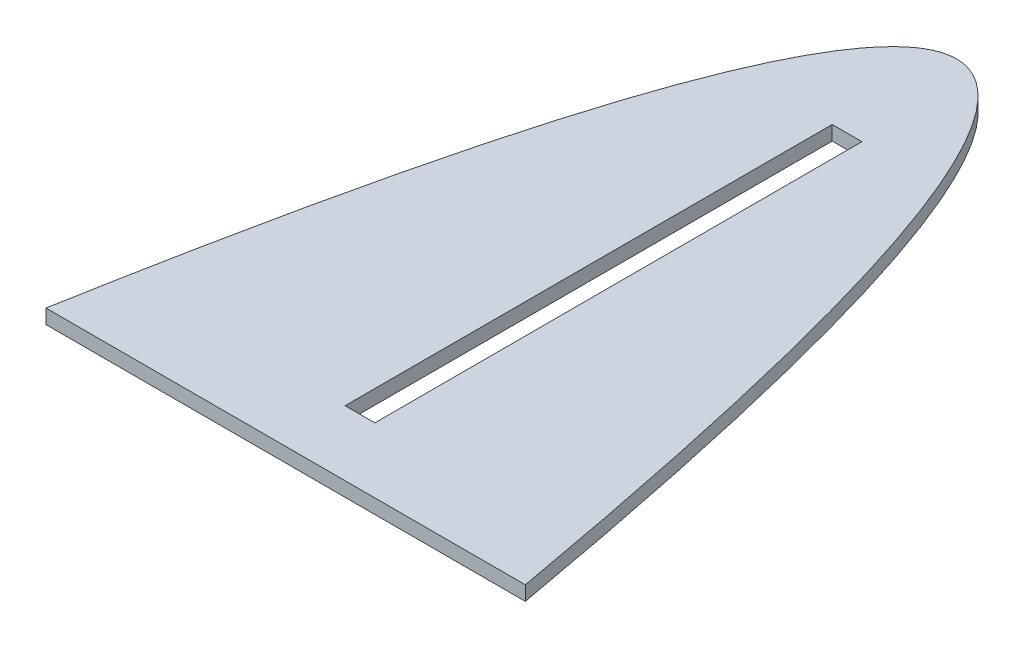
ISO-10303-21;
HEADER;
FILE_DESCRIPTION(('STEP AP214'),'2;1');
FILE_NAME('part.step','',(''),(''),'','','');
FILE_SCHEMA(('AUTOMOTIVE_DESIGN { 1 0 10303 214 1 1 1 1 }'));
ENDSEC;
DATA;
#1=APPLICATION_CONTEXT('core data for automotive mechanical design processes');
#2=APPLICATION_PROTOCOL_DEFINITION('international standard','automotive_design',2000,#1);
#3=PRODUCT_CONTEXT('',#1,'mechanical');
#4=PRODUCT('Part','Part','',(#3));
#5=PRODUCT_RELATED_PRODUCT_CATEGORY('part','',(#4));
#6=PRODUCT_DEFINITION_FORMATION('','',#4);
#7=PRODUCT_DEFINITION_CONTEXT('part definition',#1,'design');
#8=PRODUCT_DEFINITION('design','',#6,#7);
#9=PRODUCT_DEFINITION_SHAPE('','',#8);
#10=(LENGTH_UNIT() NAMED_UNIT(*) SI_UNIT(.MILLI.,.METRE.));
#11=(NAMED_UNIT(*) PLANE_ANGLE_UNIT() SI_UNIT($,.RADIAN.));
#12=(NAMED_UNIT(*) SI_UNIT($,.STERADIAN.) SOLID_ANGLE_UNIT());
#13=UNCERTAINTY_MEASURE_WITH_UNIT(LENGTH_MEASURE(1.E-05),#10,'distance_accuracy_value','');
#14=(GEOMETRIC_REPRESENTATION_CONTEXT(3) GLOBAL_UNCERTAINTY_ASSIGNED_CONTEXT((#13)) GLOBAL_UNIT_ASSIGNED_CONTEXT((#10,
#11,#12)) REPRESENTATION_CONTEXT('',''));
#15=CARTESIAN_POINT('',(0.,0.,0.));
#16=DIRECTION('',(0.,0.,1.));
#17=DIRECTION('',(1.,0.,0.));
#18=AXIS2_PLACEMENT_3D('',#15,#16,#17);
#19=CARTESIAN_POINT('',(100.,3.,0.));
#20=CARTESIAN_POINT('',(50.,3.,-280.));
#21=CARTESIAN_POINT('',(0.,3.,0.));
#22=B_SPLINE_CURVE_WITH_KNOTS('',2,(#19,#20,#21),.UNSPECIFIED.,.F.,.F.,(3,3),(0.,1.),.UNSPECIFIED.);
#23=DIRECTION('',(0.,-1.,0.));
#24=VECTOR('',#23,1.);
#25=SURFACE_OF_LINEAR_EXTRUSION('',#22,#24);
#26=CARTESIAN_POINT('',(100.,0.,0.));
#27=CARTESIAN_POINT('',(50.,0.,-280.));
#28=CARTESIAN_POINT('',(0.,0.,0.));
#29=B_SPLINE_CURVE_WITH_KNOTS('',2,(#26,#27,#28),.UNSPECIFIED.,.F.,.F.,(3,3),(0.,1.),.UNSPECIFIED.);
#30=CARTESIAN_POINT('',(100.,0.,0.));
#31=VERTEX_POINT('',#30);
#32=CARTESIAN_POINT('',(0.,0.,0.));
#33=VERTEX_POINT('',#32);
#34=EDGE_CURVE('E102',#31,#33,#29,.T.);
#35=ORIENTED_EDGE('',*,*,#34,.T.);
#36=DIRECTION('',(0.,-1.,0.));
#37=VECTOR('',#36,1.);
#38=CARTESIAN_POINT('',(0.,3.,0.));
#39=LINE('',#38,#37);
#40=CARTESIAN_POINT('',(0.,3.,0.));
#41=VERTEX_POINT('',#40);
#42=EDGE_CURVE('E11',#41,#33,#39,.T.);
#43=ORIENTED_EDGE('',*,*,#42,.F.);
#44=CARTESIAN_POINT('',(100.,3.,0.));
#45=VERTEX_POINT('',#44);
#46=EDGE_CURVE('E124',#45,#41,#22,.T.);
#47=ORIENTED_EDGE('',*,*,#46,.F.);
#48=DIRECTION('',(0.,-1.,0.));
#49=VECTOR('',#48,1.);
#50=CARTESIAN_POINT('',(100.,3.,0.));
#51=LINE('',#50,#49);
#52=EDGE_CURVE('E43',#45,#31,#51,.T.);
#53=ORIENTED_EDGE('',*,*,#52,.T.);
#54=EDGE_LOOP('',(#35,#43,#47,#53));
#55=FACE_BOUND('',#54,.T.);
#56=ADVANCED_FACE('F35',(#55),#25,.F.);
#57=CARTESIAN_POINT('',(0.,3.,0.));
#58=DIRECTION('',(0.,0.,-1.));
#59=DIRECTION('',(-1.,0.,0.));
#60=AXIS2_PLACEMENT_3D('',#57,#58,#59);
#61=PLANE('',#60);
#62=DIRECTION('',(1.,0.,0.));
#63=VECTOR('',#62,1.);
#64=CARTESIAN_POINT('',(0.,0.,0.));
#65=LINE('',#64,#63);
#66=EDGE_CURVE('E131',#33,#31,#65,.T.);
#67=ORIENTED_EDGE('',*,*,#66,.T.);
#68=ORIENTED_EDGE('',*,*,#52,.F.);
#69=DIRECTION('',(1.,0.,0.));
#70=VECTOR('',#69,1.);
#71=CARTESIAN_POINT('',(0.,3.,0.));
#72=LINE('',#71,#70);
#73=EDGE_CURVE('E130',#41,#45,#72,.T.);
#74=ORIENTED_EDGE('',*,*,#73,.F.);
#75=ORIENTED_EDGE('',*,*,#42,.T.);
#76=EDGE_LOOP('',(#67,#68,#74,#75));
#77=FACE_BOUND('',#76,.T.);
#78=ADVANCED_FACE('F150',(#77),#61,.F.);
#79=CARTESIAN_POINT('',(50.,3.,-140.));
#80=DIRECTION('',(0.,1.,0.));
#81=DIRECTION('',(0.,0.,1.));
#82=AXIS2_PLACEMENT_3D('',#79,#80,#81);
#83=PLANE('',#82);
#84=DIRECTION('',(0.,0.,1.));
#85=VECTOR('',#84,1.);
#86=CARTESIAN_POINT('',(48.8514830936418,3.,-115.171268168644));
#87=LINE('',#86,#85);
#88=CARTESIAN_POINT('',(48.8514830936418,3.,-115.171268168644));
#89=VERTEX_POINT('',#88);
#90=CARTESIAN_POINT('',(48.8514830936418,3.,-13.5606255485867));
#91=VERTEX_POINT('',#90);
#92=EDGE_CURVE('E50',#89,#91,#87,.T.);
#93=ORIENTED_EDGE('',*,*,#92,.F.);
#94=DIRECTION('',(-1.,0.,0.));
#95=VECTOR('',#94,1.);
#96=CARTESIAN_POINT('',(48.8514830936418,3.,-115.171268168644));
#97=LINE('',#96,#95);
#98=CARTESIAN_POINT('',(55.0514830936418,3.,-115.171268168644));
#99=VERTEX_POINT('',#98);
#100=EDGE_CURVE('E96',#99,#89,#97,.T.);
#101=ORIENTED_EDGE('',*,*,#100,.F.);
#102=DIRECTION('',(0.,0.,-1.));
#103=VECTOR('',#102,1.);
#104=CARTESIAN_POINT('',(55.0514830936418,3.,-115.171268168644));
#105=LINE('',#104,#103);
#106=CARTESIAN_POINT('',(55.0514830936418,3.,-13.5606255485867));
#107=VERTEX_POINT('',#106);
#108=EDGE_CURVE('E116',#107,#99,#105,.T.);
#109=ORIENTED_EDGE('',*,*,#108,.F.);
#110=DIRECTION('',(1.,0.,0.));
#111=VECTOR('',#110,1.);
#112=CARTESIAN_POINT('',(48.8514830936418,3.,-13.5606255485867));
#113=LINE('',#112,#111);
#114=EDGE_CURVE('E110',#91,#107,#113,.T.);
#115=ORIENTED_EDGE('',*,*,#114,.F.);
#116=EDGE_LOOP('',(#93,#101,#109,#115));
#117=FACE_BOUND('',#116,.T.);
#118=ORIENTED_EDGE('',*,*,#46,.T.);
#119=ORIENTED_EDGE('',*,*,#73,.T.);
#120=EDGE_LOOP('',(#118,#119));
#121=FACE_BOUND('',#120,.T.);
#122=ADVANCED_FACE('F152',(#117,#121),#83,.T.);
#123=CARTESIAN_POINT('',(50.,0.,-140.));
#124=DIRECTION('',(0.,1.,0.));
#125=DIRECTION('',(0.,0.,1.));
#126=AXIS2_PLACEMENT_3D('',#123,#124,#125);
#127=PLANE('',#126);
#128=DIRECTION('',(1.,0.,0.));
#129=VECTOR('',#128,1.);
#130=CARTESIAN_POINT('',(48.8514830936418,0.,-115.171268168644));
#131=LINE('',#130,#129);
#132=CARTESIAN_POINT('',(48.8514830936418,0.,-115.171268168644));
#133=VERTEX_POINT('',#132);
#134=CARTESIAN_POINT('',(55.0514830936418,0.,-115.171268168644));
#135=VERTEX_POINT('',#134);
#136=EDGE_CURVE('E108',#133,#135,#131,.T.);
#137=ORIENTED_EDGE('',*,*,#136,.F.);
#138=DIRECTION('',(0.,0.,-1.));
#139=VECTOR('',#138,1.);
#140=CARTESIAN_POINT('',(48.8514830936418,0.,-115.171268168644));
#141=LINE('',#140,#139);
#142=CARTESIAN_POINT('',(48.8514830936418,0.,-13.5606255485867));
#143=VERTEX_POINT('',#142);
#144=EDGE_CURVE('E90',#143,#133,#141,.T.);
#145=ORIENTED_EDGE('',*,*,#144,.F.);
#146=DIRECTION('',(-1.,0.,0.));
#147=VECTOR('',#146,1.);
#148=CARTESIAN_POINT('',(48.8514830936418,0.,-13.5606255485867));
#149=LINE('',#148,#147);
#150=CARTESIAN_POINT('',(55.0514830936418,0.,-13.5606255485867));
#151=VERTEX_POINT('',#150);
#152=EDGE_CURVE('E99',#151,#143,#149,.T.);
#153=ORIENTED_EDGE('',*,*,#152,.F.);
#154=DIRECTION('',(0.,0.,1.));
#155=VECTOR('',#154,1.);
#156=CARTESIAN_POINT('',(55.0514830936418,0.,-115.171268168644));
#157=LINE('',#156,#155);
#158=EDGE_CURVE('E58',#135,#151,#157,.T.);
#159=ORIENTED_EDGE('',*,*,#158,.F.);
#160=EDGE_LOOP('',(#137,#145,#153,#159));
#161=FACE_BOUND('',#160,.T.);
#162=ORIENTED_EDGE('',*,*,#34,.F.);
#163=ORIENTED_EDGE('',*,*,#66,.F.);
#164=EDGE_LOOP('',(#162,#163));
#165=FACE_BOUND('',#164,.T.);
#166=ADVANCED_FACE('F105',(#161,#165),#127,.F.);
#167=CARTESIAN_POINT('',(48.8514830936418,-0.00100000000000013,-115.171268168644));
#168=DIRECTION('',(-1.,0.,0.));
#169=DIRECTION('',(0.,0.,1.));
#170=AXIS2_PLACEMENT_3D('',#167,#168,#169);
#171=PLANE('',#170);
#172=ORIENTED_EDGE('',*,*,#144,.T.);
#173=DIRECTION('',(0.,1.,0.));
#174=VECTOR('',#173,1.);
#175=CARTESIAN_POINT('',(48.8514830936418,-0.00100000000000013,-115.171268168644));
#176=LINE('',#175,#174);
#177=EDGE_CURVE('E103',#133,#89,#176,.T.);
#178=ORIENTED_EDGE('',*,*,#177,.T.);
#179=ORIENTED_EDGE('',*,*,#92,.T.);
#180=DIRECTION('',(0.,1.,0.));
#181=VECTOR('',#180,1.);
#182=CARTESIAN_POINT('',(48.8514830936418,-0.00100000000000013,-13.5606255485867));
#183=LINE('',#182,#181);
#184=EDGE_CURVE('E86',#143,#91,#183,.T.);
#185=ORIENTED_EDGE('',*,*,#184,.F.);
#186=EDGE_LOOP('',(#172,#178,#179,#185));
#187=FACE_BOUND('',#186,.T.);
#188=ADVANCED_FACE('F88',(#187),#171,.F.);
#189=CARTESIAN_POINT('',(48.8514830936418,-0.00100000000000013,-115.171268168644));
#190=DIRECTION('',(0.,0.,-1.));
#191=DIRECTION('',(-1.,0.,0.));
#192=AXIS2_PLACEMENT_3D('',#189,#190,#191);
#193=PLANE('',#192);
#194=ORIENTED_EDGE('',*,*,#136,.T.);
#195=DIRECTION('',(0.,1.,0.));
#196=VECTOR('',#195,1.);
#197=CARTESIAN_POINT('',(55.0514830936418,-0.00100000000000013,-115.171268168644));
#198=LINE('',#197,#196);
#199=EDGE_CURVE('E122',#135,#99,#198,.T.);
#200=ORIENTED_EDGE('',*,*,#199,.T.);
#201=ORIENTED_EDGE('',*,*,#100,.T.);
#202=ORIENTED_EDGE('',*,*,#177,.F.);
#203=EDGE_LOOP('',(#194,#200,#201,#202));
#204=FACE_BOUND('',#203,.T.);
#205=ADVANCED_FACE('F186',(#204),#193,.F.);
#206=CARTESIAN_POINT('',(55.0514830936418,-0.00100000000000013,-115.171268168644));
#207=DIRECTION('',(1.,0.,0.));
#208=DIRECTION('',(0.,0.,-1.));
#209=AXIS2_PLACEMENT_3D('',#206,#207,#208);
#210=PLANE('',#209);
#211=ORIENTED_EDGE('',*,*,#158,.T.);
#212=DIRECTION('',(0.,1.,0.));
#213=VECTOR('',#212,1.);
#214=CARTESIAN_POINT('',(55.0514830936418,-0.00100000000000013,-13.5606255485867));
#215=LINE('',#214,#213);
#216=EDGE_CURVE('E95',#151,#107,#215,.T.);
#217=ORIENTED_EDGE('',*,*,#216,.T.);
#218=ORIENTED_EDGE('',*,*,#108,.T.);
#219=ORIENTED_EDGE('',*,*,#199,.F.);
#220=EDGE_LOOP('',(#211,#217,#218,#219));
#221=FACE_BOUND('',#220,.T.);
#222=ADVANCED_FACE('F191',(#221),#210,.F.);
#223=CARTESIAN_POINT('',(48.8514830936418,-0.00100000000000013,-13.5606255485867));
#224=DIRECTION('',(0.,0.,1.));
#225=DIRECTION('',(1.,0.,0.));
#226=AXIS2_PLACEMENT_3D('',#223,#224,#225);
#227=PLANE('',#226);
#228=ORIENTED_EDGE('',*,*,#152,.T.);
#229=ORIENTED_EDGE('',*,*,#184,.T.);
#230=ORIENTED_EDGE('',*,*,#114,.T.);
#231=ORIENTED_EDGE('',*,*,#216,.F.);
#232=EDGE_LOOP('',(#228,#229,#230,#231));
#233=FACE_BOUND('',#232,.T.);
#234=ADVANCED_FACE('F100',(#233),#227,.F.);
#235=CLOSED_SHELL('',(#56,#78,#122,#166,#188,#205,#222,#234));
#236=MANIFOLD_SOLID_BREP('B2',#235);
#237=ADVANCED_BREP_SHAPE_REPRESENTATION('',(#18,#236),#14);
#238=SHAPE_DEFINITION_REPRESENTATION(#9,#237);
ENDSEC;
END-ISO-10303-21;
